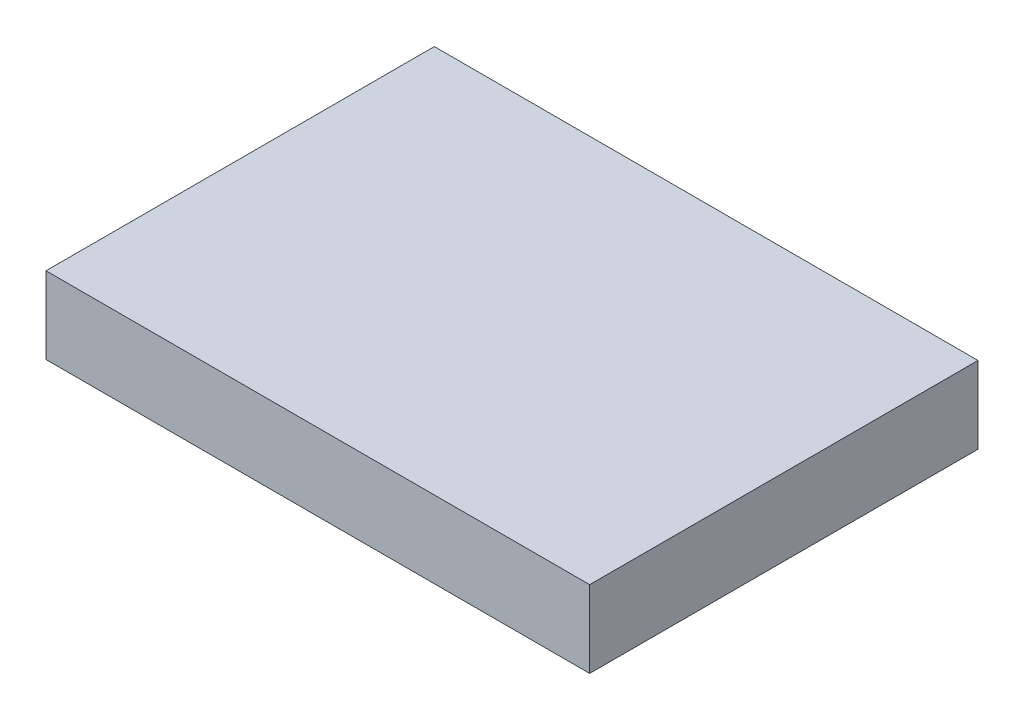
from build123d import *

# Parameters (mm, degrees)
ESQUISSE1_W          = 70
ESQUISSE1_H          = 9.9
BASE_EXTRUSION_DEPTH = 25


with BuildPart() as part:
    # Esquisse1 → Base-Extrusion (new, symmetric)
    with BuildSketch(Plane.XY):
        with Locations((35, 4.95)):
            Rectangle(ESQUISSE1_W, ESQUISSE1_H)
    extrude(amount=BASE_EXTRUSION_DEPTH, both=True)


solid = part.part
